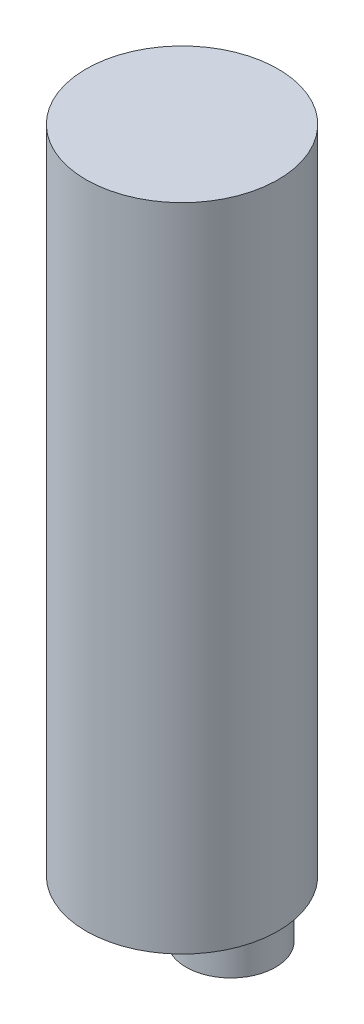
ISO-10303-21;
HEADER;
FILE_DESCRIPTION(('STEP AP214'),'2;1');
FILE_NAME('part.step','',(''),(''),'','','');
FILE_SCHEMA(('AUTOMOTIVE_DESIGN { 1 0 10303 214 1 1 1 1 }'));
ENDSEC;
DATA;
#1=APPLICATION_CONTEXT('core data for automotive mechanical design processes');
#2=APPLICATION_PROTOCOL_DEFINITION('international standard','automotive_design',2000,#1);
#3=PRODUCT_CONTEXT('',#1,'mechanical');
#4=PRODUCT('Part','Part','',(#3));
#5=PRODUCT_RELATED_PRODUCT_CATEGORY('part','',(#4));
#6=PRODUCT_DEFINITION_FORMATION('','',#4);
#7=PRODUCT_DEFINITION_CONTEXT('part definition',#1,'design');
#8=PRODUCT_DEFINITION('design','',#6,#7);
#9=PRODUCT_DEFINITION_SHAPE('','',#8);
#10=(LENGTH_UNIT() NAMED_UNIT(*) SI_UNIT(.MILLI.,.METRE.));
#11=(NAMED_UNIT(*) PLANE_ANGLE_UNIT() SI_UNIT($,.RADIAN.));
#12=(NAMED_UNIT(*) SI_UNIT($,.STERADIAN.) SOLID_ANGLE_UNIT());
#13=UNCERTAINTY_MEASURE_WITH_UNIT(LENGTH_MEASURE(1.E-05),#10,'distance_accuracy_value','');
#14=(GEOMETRIC_REPRESENTATION_CONTEXT(3) GLOBAL_UNCERTAINTY_ASSIGNED_CONTEXT((#13)) GLOBAL_UNIT_ASSIGNED_CONTEXT((#10,
#11,#12)) REPRESENTATION_CONTEXT('',''));
#15=CARTESIAN_POINT('',(0.,0.,0.));
#16=DIRECTION('',(0.,0.,1.));
#17=DIRECTION('',(1.,0.,0.));
#18=AXIS2_PLACEMENT_3D('',#15,#16,#17);
#19=CARTESIAN_POINT('',(-5.,-11.,4.));
#20=DIRECTION('',(0.,-1.,0.));
#21=DIRECTION('',(1.,0.,0.));
#22=AXIS2_PLACEMENT_3D('',#19,#20,#21);
#23=PLANE('',#22);
#24=CARTESIAN_POINT('',(-5.,-11.,4.));
#25=DIRECTION('',(0.,-1.,0.));
#26=DIRECTION('',(0.,0.,-1.));
#27=AXIS2_PLACEMENT_3D('',#24,#25,#26);
#28=CIRCLE('',#27,1.375);
#29=CARTESIAN_POINT('',(-5.,-11.,2.625));
#30=VERTEX_POINT('',#29);
#31=EDGE_CURVE('E18',#30,#30,#28,.F.);
#32=ORIENTED_EDGE('',*,*,#31,.F.);
#33=EDGE_LOOP('',(#32));
#34=FACE_BOUND('',#33,.T.);
#35=ADVANCED_FACE('F15',(#34),#23,.T.);
#36=CARTESIAN_POINT('',(-8.,-11.,4.));
#37=DIRECTION('',(0.,-1.,0.));
#38=DIRECTION('',(1.,0.,0.));
#39=AXIS2_PLACEMENT_3D('',#36,#37,#38);
#40=PLANE('',#39);
#41=CARTESIAN_POINT('',(-8.,-11.,4.));
#42=DIRECTION('',(0.,-1.,0.));
#43=DIRECTION('',(0.,0.,-1.));
#44=AXIS2_PLACEMENT_3D('',#41,#42,#43);
#45=CIRCLE('',#44,1.375);
#46=CARTESIAN_POINT('',(-8.,-11.,2.625));
#47=VERTEX_POINT('',#46);
#48=EDGE_CURVE('E34',#47,#47,#45,.F.);
#49=ORIENTED_EDGE('',*,*,#48,.F.);
#50=EDGE_LOOP('',(#49));
#51=FACE_BOUND('',#50,.T.);
#52=ADVANCED_FACE('F44',(#51),#40,.T.);
#53=CARTESIAN_POINT('',(-5.,-10.,4.));
#54=DIRECTION('',(0.,-1.,0.));
#55=DIRECTION('',(0.,0.,-1.));
#56=AXIS2_PLACEMENT_3D('',#53,#54,#55);
#57=CYLINDRICAL_SURFACE('',#56,1.375);
#58=CARTESIAN_POINT('',(-5.,-10.,4.));
#59=DIRECTION('',(0.,-1.,0.));
#60=DIRECTION('',(0.,0.,-1.));
#61=AXIS2_PLACEMENT_3D('',#58,#59,#60);
#62=CIRCLE('',#61,1.375);
#63=CARTESIAN_POINT('',(-5.,-10.,2.625));
#64=VERTEX_POINT('',#63);
#65=EDGE_CURVE('E32',#64,#64,#62,.T.);
#66=ORIENTED_EDGE('',*,*,#65,.T.);
#67=EDGE_LOOP('',(#66));
#68=FACE_BOUND('',#67,.T.);
#69=ORIENTED_EDGE('',*,*,#31,.T.);
#70=EDGE_LOOP('',(#69));
#71=FACE_BOUND('',#70,.T.);
#72=ADVANCED_FACE('F41',(#68,#71),#57,.T.);
#73=CARTESIAN_POINT('',(-8.,-10.,4.));
#74=DIRECTION('',(0.,-1.,0.));
#75=DIRECTION('',(0.,0.,-1.));
#76=AXIS2_PLACEMENT_3D('',#73,#74,#75);
#77=CYLINDRICAL_SURFACE('',#76,1.375);
#78=CARTESIAN_POINT('',(-8.,-10.,4.));
#79=DIRECTION('',(0.,-1.,0.));
#80=DIRECTION('',(0.,0.,-1.));
#81=AXIS2_PLACEMENT_3D('',#78,#79,#80);
#82=CIRCLE('',#81,1.375);
#83=CARTESIAN_POINT('',(-8.,-10.,2.625));
#84=VERTEX_POINT('',#83);
#85=EDGE_CURVE('E27',#84,#84,#82,.T.);
#86=ORIENTED_EDGE('',*,*,#85,.T.);
#87=EDGE_LOOP('',(#86));
#88=FACE_BOUND('',#87,.T.);
#89=ORIENTED_EDGE('',*,*,#48,.T.);
#90=EDGE_LOOP('',(#89));
#91=FACE_BOUND('',#90,.T.);
#92=ADVANCED_FACE('F64',(#88,#91),#77,.T.);
#93=CARTESIAN_POINT('',(-6.5,10.,4.));
#94=DIRECTION('',(0.,1.,0.));
#95=DIRECTION('',(-1.,0.,0.));
#96=AXIS2_PLACEMENT_3D('',#93,#94,#95);
#97=PLANE('',#96);
#98=CARTESIAN_POINT('',(-6.5,10.,4.));
#99=DIRECTION('',(0.,1.,0.));
#100=DIRECTION('',(0.,0.,1.));
#101=AXIS2_PLACEMENT_3D('',#98,#99,#100);
#102=CIRCLE('',#101,2.95);
#103=CARTESIAN_POINT('',(-6.5,10.,6.95));
#104=VERTEX_POINT('',#103);
#105=EDGE_CURVE('E22',#104,#104,#102,.F.);
#106=ORIENTED_EDGE('',*,*,#105,.F.);
#107=EDGE_LOOP('',(#106));
#108=FACE_BOUND('',#107,.T.);
#109=ADVANCED_FACE('F57',(#108),#97,.T.);
#110=CARTESIAN_POINT('',(-6.5,-10.,4.));
#111=DIRECTION('',(0.,1.,0.));
#112=DIRECTION('',(-1.,0.,0.));
#113=AXIS2_PLACEMENT_3D('',#110,#111,#112);
#114=PLANE('',#113);
#115=ORIENTED_EDGE('',*,*,#85,.F.);
#116=EDGE_LOOP('',(#115));
#117=FACE_BOUND('',#116,.T.);
#118=ORIENTED_EDGE('',*,*,#65,.F.);
#119=EDGE_LOOP('',(#118));
#120=FACE_BOUND('',#119,.T.);
#121=CARTESIAN_POINT('',(-6.5,-10.,4.));
#122=DIRECTION('',(0.,1.,0.));
#123=DIRECTION('',(0.,0.,1.));
#124=AXIS2_PLACEMENT_3D('',#121,#122,#123);
#125=CIRCLE('',#124,2.95);
#126=CARTESIAN_POINT('',(-6.5,-10.,6.95));
#127=VERTEX_POINT('',#126);
#128=EDGE_CURVE('E10',#127,#127,#125,.T.);
#129=ORIENTED_EDGE('',*,*,#128,.F.);
#130=EDGE_LOOP('',(#129));
#131=FACE_BOUND('',#130,.T.);
#132=ADVANCED_FACE('F52',(#117,#120,#131),#114,.F.);
#133=CARTESIAN_POINT('',(-6.5,0.,4.));
#134=DIRECTION('',(0.,1.,0.));
#135=DIRECTION('',(0.,0.,1.));
#136=AXIS2_PLACEMENT_3D('',#133,#134,#135);
#137=CYLINDRICAL_SURFACE('',#136,2.95);
#138=ORIENTED_EDGE('',*,*,#128,.T.);
#139=EDGE_LOOP('',(#138));
#140=FACE_BOUND('',#139,.T.);
#141=ORIENTED_EDGE('',*,*,#105,.T.);
#142=EDGE_LOOP('',(#141));
#143=FACE_BOUND('',#142,.T.);
#144=ADVANCED_FACE('F50',(#140,#143),#137,.T.);
#145=CLOSED_SHELL('',(#35,#52,#72,#92,#109,#132,#144));
#146=MANIFOLD_SOLID_BREP('B1',#145);
#147=ADVANCED_BREP_SHAPE_REPRESENTATION('',(#18,#146),#14);
#148=SHAPE_DEFINITION_REPRESENTATION(#9,#147);
ENDSEC;
END-ISO-10303-21;
